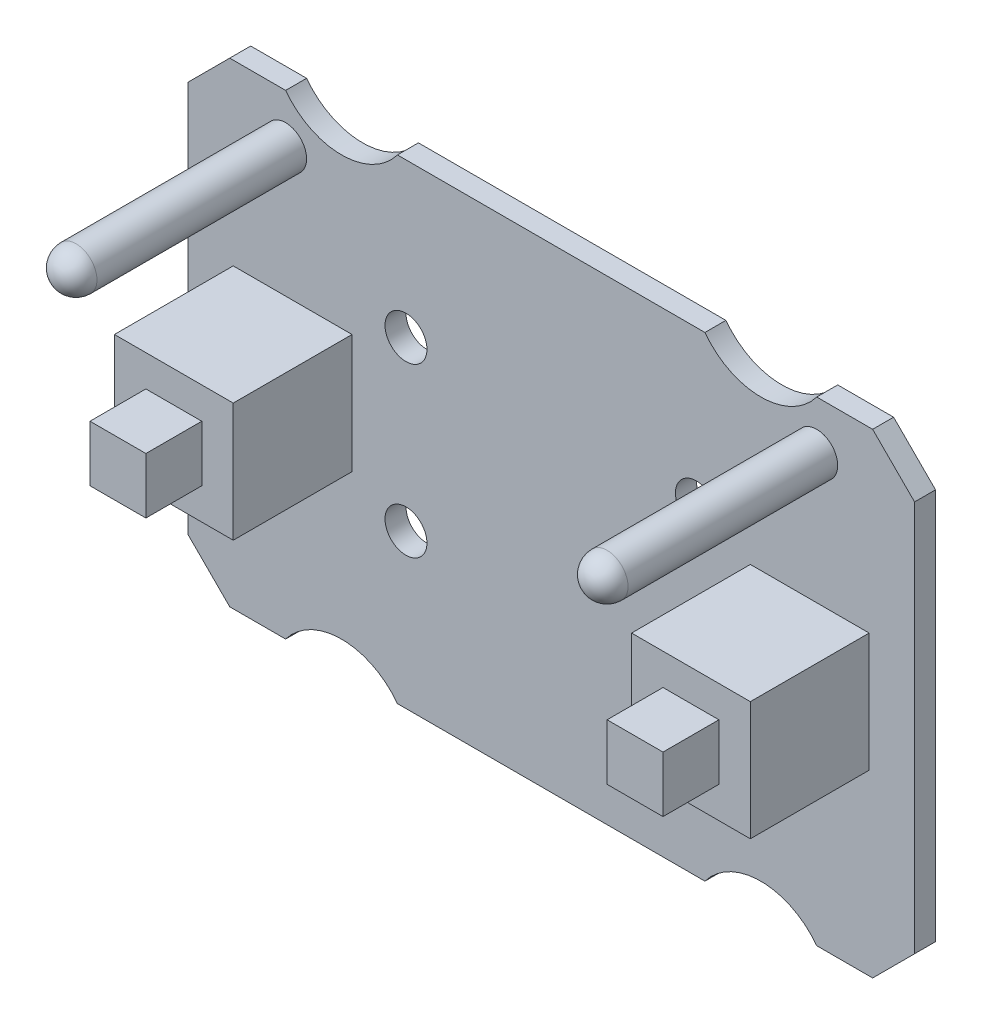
from build123d import *

# Parameters (mm, degrees)
ESQUISSE1_W                     = 52
ESQUISSE1_H                     = 34
EXTRUSION1_DEPTH                = 1.5
CHANFREIN1_SIZE                 = 3
ESQUISSE2_R                     = 5
ENL_V_MAT_EXTRU_1_DEPTH         = 32.10064308
ESQUISSE3_R                     = 1.5
EXTRUSION2_DEPTH                = 16.5
CONG_2_R                        = 1.5
ESQUISSE4_W                     = 8.5
ESQUISSE4_H                     = 8.5
EXTRUSION3_DEPTH                = 8.5
ESQUISSE5_W                     = 4
ESQUISSE5_H                     = 4
EXTRUSION4_DEPTH                = 4
R_P_TITION_LIN_AIRE1_COUNT      = 2
R_P_TITION_LIN_AIRE1_PITCH      = 37
ESQUISSE6_R                     = 1.5
ENL_V_MAT_EXTRU_2_DEPTH         = 36.174564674
R_P_TITION_LIN_AIRE2_COUNT      = 2
R_P_TITION_LIN_AIRE2_PITCH      = 20.78
R_P_TITION_LIN_AIRE2_COUNT_DIR2 = 2
R_P_TITION_LIN_AIRE2_PITCH_DIR2 = 12
ESQUISSE7_R                     = 0.3
EXTRUSION5_DEPTH                = 5
R_P_TITION_LIN_AIRE3_COUNT      = 4
R_P_TITION_LIN_AIRE3_PITCH      = 2


with BuildPart() as part:
    # Esquisse1 → Extrusion1 (new body)
    with BuildSketch(Plane.XY):
        Rectangle(ESQUISSE1_W, ESQUISSE1_H)
    extrude(amount=EXTRUSION1_DEPTH)

    # Chanfrein1
    chanfrein1_edges = [part.edges().sort_by_distance(p)[0] for p in [
        (-26, 17, 0.75),
        (26, 17, 0.75),
        (26, -17, 0.75),
        (-26, -17, 0.75),
    ]]
    chamfer(chanfrein1_edges, length=CHANFREIN1_SIZE)

    # Esquisse2 → Enl_v. mat.-Extru.1 (cut, through all)
    with BuildSketch(Plane.XY.offset(1.5)):
        with Locations((-15, 20)):
            Circle(ESQUISSE2_R)
        with Locations((15, 20)):
            Circle(ESQUISSE2_R)
        with Locations((-15, -20)):
            Circle(ESQUISSE2_R)
        with Locations((15, -20)):
            Circle(ESQUISSE2_R)
    extrude(amount=-ENL_V_MAT_EXTRU_1_DEPTH, mode=Mode.SUBTRACT)

    # Esquisse3 → Extrusion2 (add)
    with BuildSketch(Plane.XY.offset(1.5)):
        with Locations((-19, 13.5)):
            Circle(ESQUISSE3_R)
        with Locations((19, 13.5)):
            Circle(ESQUISSE3_R)
    extrude(amount=EXTRUSION2_DEPTH)

    # Cong_2
    cong_2_edges = [part.edges().sort_by_distance(p)[0] for p in [
        (-20.5, 13.5, 18),
        (17.5, 13.5, 18),
    ]]
    fillet(cong_2_edges, radius=CONG_2_R)

    # Esquisse4 → Extrusion3 (add)
    with BuildSketch(Plane.XY.offset(1.5)):
        with Locations((-18.5, 0)):
            Rectangle(ESQUISSE4_W, ESQUISSE4_H)
    extrusion3 = extrude(amount=EXTRUSION3_DEPTH)

    # Esquisse5 → Extrusion4 (add)
    with BuildSketch(Plane.XY.offset(10)):
        with Locations((-18.5, 0)):
            Rectangle(ESQUISSE5_W, ESQUISSE5_H)
    extrusion4 = extrude(amount=EXTRUSION4_DEPTH)

    # R_p_tition lin_aire1: Extrusion3, Extrusion4 ×2
    with Locations(*[(i * R_P_TITION_LIN_AIRE1_PITCH, 0, 0) for i in range(1, R_P_TITION_LIN_AIRE1_COUNT)]):
        add(extrusion3)
        add(extrusion4)

    # Esquisse6 → Enl_v. mat.-Extru.2 (cut, through all)
    with BuildSketch(Plane.XY.offset(1.5)):
        with Locations((-10.39, 6)):
            Circle(ESQUISSE6_R)
    enl_v_mat_extru_2 = extrude(amount=-ENL_V_MAT_EXTRU_2_DEPTH, mode=Mode.SUBTRACT)

    # R_p_tition lin_aire2: Enl_v. mat.-Extru.2 2 × 2
    with Locations(*[(i * R_P_TITION_LIN_AIRE2_PITCH, -j * R_P_TITION_LIN_AIRE2_PITCH_DIR2, 0) for i in range(R_P_TITION_LIN_AIRE2_COUNT) for j in range(R_P_TITION_LIN_AIRE2_COUNT_DIR2) if (i, j) != (0, 0)]):
        add(enl_v_mat_extru_2, mode=Mode.SUBTRACT)

    # Esquisse7 → Extrusion5 (add)
    with BuildSketch(Plane(origin=(0, 0, 0), x_dir=(-1, 0, 0), z_dir=(0, 0, -1))):
        with Locations(Location((22.5, -12.5, 0), (0, 0, 180))):
            Circle(ESQUISSE7_R)
    extrusion5 = extrude(amount=EXTRUSION5_DEPTH)

    # R_p_tition lin_aire3: Extrusion5 ×4
    with Locations(*[(0, i * R_P_TITION_LIN_AIRE3_PITCH, 0) for i in range(1, R_P_TITION_LIN_AIRE3_COUNT)]):
        add(extrusion5)


solid = part.part
